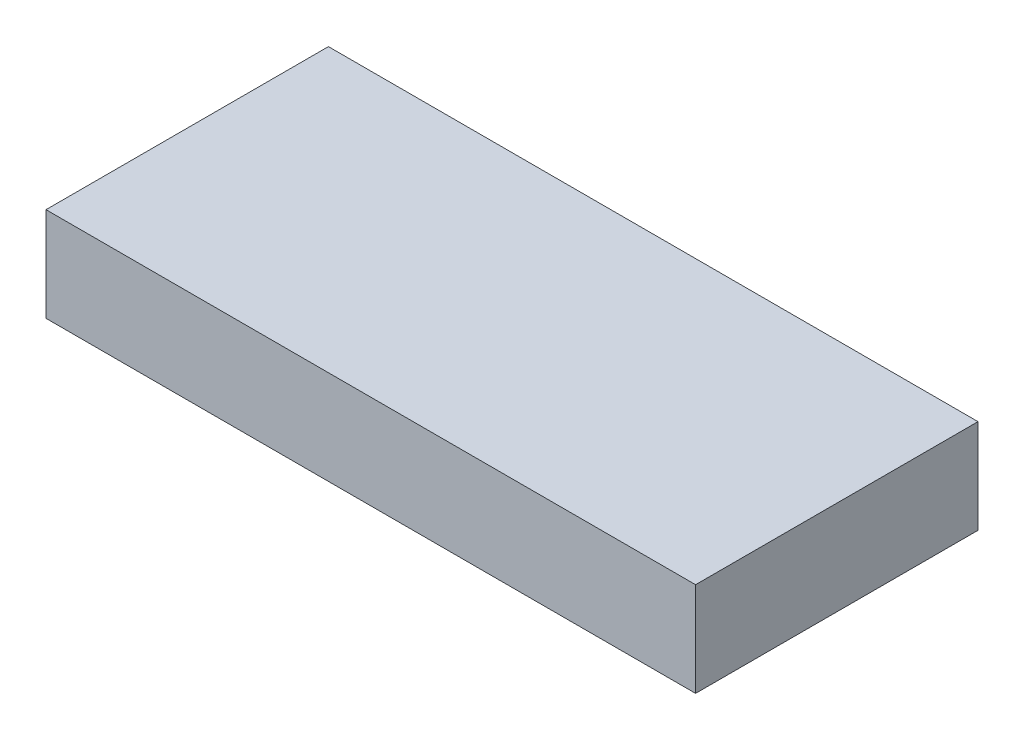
ISO-10303-21;
HEADER;
FILE_DESCRIPTION(('STEP AP214'),'2;1');
FILE_NAME('part.step','',(''),(''),'','','');
FILE_SCHEMA(('AUTOMOTIVE_DESIGN { 1 0 10303 214 1 1 1 1 }'));
ENDSEC;
DATA;
#1=APPLICATION_CONTEXT('core data for automotive mechanical design processes');
#2=APPLICATION_PROTOCOL_DEFINITION('international standard','automotive_design',2000,#1);
#3=PRODUCT_CONTEXT('',#1,'mechanical');
#4=PRODUCT('Part','Part','',(#3));
#5=PRODUCT_RELATED_PRODUCT_CATEGORY('part','',(#4));
#6=PRODUCT_DEFINITION_FORMATION('','',#4);
#7=PRODUCT_DEFINITION_CONTEXT('part definition',#1,'design');
#8=PRODUCT_DEFINITION('design','',#6,#7);
#9=PRODUCT_DEFINITION_SHAPE('','',#8);
#10=(LENGTH_UNIT() NAMED_UNIT(*) SI_UNIT(.MILLI.,.METRE.));
#11=(NAMED_UNIT(*) PLANE_ANGLE_UNIT() SI_UNIT($,.RADIAN.));
#12=(NAMED_UNIT(*) SI_UNIT($,.STERADIAN.) SOLID_ANGLE_UNIT());
#13=UNCERTAINTY_MEASURE_WITH_UNIT(LENGTH_MEASURE(1.E-05),#10,'distance_accuracy_value','');
#14=(GEOMETRIC_REPRESENTATION_CONTEXT(3) GLOBAL_UNCERTAINTY_ASSIGNED_CONTEXT((#13)) GLOBAL_UNIT_ASSIGNED_CONTEXT((#10,
#11,#12)) REPRESENTATION_CONTEXT('',''));
#15=CARTESIAN_POINT('',(0.,0.,0.));
#16=DIRECTION('',(0.,0.,1.));
#17=DIRECTION('',(1.,0.,0.));
#18=AXIS2_PLACEMENT_3D('',#15,#16,#17);
#19=CARTESIAN_POINT('',(69.,5.,15.));
#20=DIRECTION('',(0.,0.,-1.));
#21=DIRECTION('',(0.,1.,0.));
#22=AXIS2_PLACEMENT_3D('',#19,#20,#21);
#23=PLANE('',#22);
#24=DIRECTION('',(0.,-1.,0.));
#25=VECTOR('',#24,1.);
#26=CARTESIAN_POINT('',(0.,5.,15.));
#27=LINE('',#26,#25);
#28=CARTESIAN_POINT('',(0.,5.,15.));
#29=VERTEX_POINT('',#28);
#30=CARTESIAN_POINT('',(0.,-5.,15.));
#31=VERTEX_POINT('',#30);
#32=EDGE_CURVE('E77',#29,#31,#27,.T.);
#33=ORIENTED_EDGE('',*,*,#32,.T.);
#34=DIRECTION('',(-1.,0.,0.));
#35=VECTOR('',#34,1.);
#36=CARTESIAN_POINT('',(69.,-5.,15.));
#37=LINE('',#36,#35);
#38=CARTESIAN_POINT('',(69.,-5.,15.));
#39=VERTEX_POINT('',#38);
#40=EDGE_CURVE('E11',#39,#31,#37,.T.);
#41=ORIENTED_EDGE('',*,*,#40,.F.);
#42=DIRECTION('',(0.,-1.,0.));
#43=VECTOR('',#42,1.);
#44=CARTESIAN_POINT('',(69.,5.,15.));
#45=LINE('',#44,#43);
#46=CARTESIAN_POINT('',(69.,5.,15.));
#47=VERTEX_POINT('',#46);
#48=EDGE_CURVE('E95',#47,#39,#45,.T.);
#49=ORIENTED_EDGE('',*,*,#48,.F.);
#50=DIRECTION('',(-1.,0.,0.));
#51=VECTOR('',#50,1.);
#52=CARTESIAN_POINT('',(69.,5.,15.));
#53=LINE('',#52,#51);
#54=EDGE_CURVE('E89',#47,#29,#53,.T.);
#55=ORIENTED_EDGE('',*,*,#54,.T.);
#56=EDGE_LOOP('',(#33,#41,#49,#55));
#57=FACE_BOUND('',#56,.T.);
#58=ADVANCED_FACE('F33',(#57),#23,.F.);
#59=CARTESIAN_POINT('',(69.,-5.,15.));
#60=DIRECTION('',(0.,1.,0.));
#61=DIRECTION('',(0.,0.,1.));
#62=AXIS2_PLACEMENT_3D('',#59,#60,#61);
#63=PLANE('',#62);
#64=DIRECTION('',(0.,0.,-1.));
#65=VECTOR('',#64,1.);
#66=CARTESIAN_POINT('',(0.,-5.,15.));
#67=LINE('',#66,#65);
#68=CARTESIAN_POINT('',(0.,-5.,-15.));
#69=VERTEX_POINT('',#68);
#70=EDGE_CURVE('E73',#31,#69,#67,.T.);
#71=ORIENTED_EDGE('',*,*,#70,.T.);
#72=DIRECTION('',(-1.,0.,0.));
#73=VECTOR('',#72,1.);
#74=CARTESIAN_POINT('',(69.,-5.,-15.));
#75=LINE('',#74,#73);
#76=CARTESIAN_POINT('',(69.,-5.,-15.));
#77=VERTEX_POINT('',#76);
#78=EDGE_CURVE('E40',#77,#69,#75,.T.);
#79=ORIENTED_EDGE('',*,*,#78,.F.);
#80=DIRECTION('',(0.,0.,-1.));
#81=VECTOR('',#80,1.);
#82=CARTESIAN_POINT('',(69.,-5.,15.));
#83=LINE('',#82,#81);
#84=EDGE_CURVE('E85',#39,#77,#83,.T.);
#85=ORIENTED_EDGE('',*,*,#84,.F.);
#86=ORIENTED_EDGE('',*,*,#40,.T.);
#87=EDGE_LOOP('',(#71,#79,#85,#86));
#88=FACE_BOUND('',#87,.T.);
#89=ADVANCED_FACE('F84',(#88),#63,.F.);
#90=CARTESIAN_POINT('',(69.,5.,-15.));
#91=DIRECTION('',(0.,0.,1.));
#92=DIRECTION('',(0.,-1.,0.));
#93=AXIS2_PLACEMENT_3D('',#90,#91,#92);
#94=PLANE('',#93);
#95=DIRECTION('',(0.,1.,0.));
#96=VECTOR('',#95,1.);
#97=CARTESIAN_POINT('',(0.,5.,-15.));
#98=LINE('',#97,#96);
#99=CARTESIAN_POINT('',(0.,5.,-15.));
#100=VERTEX_POINT('',#99);
#101=EDGE_CURVE('E78',#69,#100,#98,.T.);
#102=ORIENTED_EDGE('',*,*,#101,.T.);
#103=DIRECTION('',(-1.,0.,0.));
#104=VECTOR('',#103,1.);
#105=CARTESIAN_POINT('',(69.,5.,-15.));
#106=LINE('',#105,#104);
#107=CARTESIAN_POINT('',(69.,5.,-15.));
#108=VERTEX_POINT('',#107);
#109=EDGE_CURVE('E101',#108,#100,#106,.T.);
#110=ORIENTED_EDGE('',*,*,#109,.F.);
#111=DIRECTION('',(0.,1.,0.));
#112=VECTOR('',#111,1.);
#113=CARTESIAN_POINT('',(69.,5.,-15.));
#114=LINE('',#113,#112);
#115=EDGE_CURVE('E52',#77,#108,#114,.T.);
#116=ORIENTED_EDGE('',*,*,#115,.F.);
#117=ORIENTED_EDGE('',*,*,#78,.T.);
#118=EDGE_LOOP('',(#102,#110,#116,#117));
#119=FACE_BOUND('',#118,.T.);
#120=ADVANCED_FACE('F104',(#119),#94,.F.);
#121=CARTESIAN_POINT('',(69.,5.,15.));
#122=DIRECTION('',(0.,-1.,0.));
#123=DIRECTION('',(0.,0.,-1.));
#124=AXIS2_PLACEMENT_3D('',#121,#122,#123);
#125=PLANE('',#124);
#126=DIRECTION('',(0.,0.,1.));
#127=VECTOR('',#126,1.);
#128=CARTESIAN_POINT('',(0.,5.,15.));
#129=LINE('',#128,#127);
#130=EDGE_CURVE('E93',#100,#29,#129,.T.);
#131=ORIENTED_EDGE('',*,*,#130,.T.);
#132=ORIENTED_EDGE('',*,*,#54,.F.);
#133=DIRECTION('',(0.,0.,1.));
#134=VECTOR('',#133,1.);
#135=CARTESIAN_POINT('',(69.,5.,15.));
#136=LINE('',#135,#134);
#137=EDGE_CURVE('E47',#108,#47,#136,.T.);
#138=ORIENTED_EDGE('',*,*,#137,.F.);
#139=ORIENTED_EDGE('',*,*,#109,.T.);
#140=EDGE_LOOP('',(#131,#132,#138,#139));
#141=FACE_BOUND('',#140,.T.);
#142=ADVANCED_FACE('F106',(#141),#125,.F.);
#143=CARTESIAN_POINT('',(69.,-5.,15.));
#144=DIRECTION('',(1.,0.,0.));
#145=DIRECTION('',(0.,0.,-1.));
#146=AXIS2_PLACEMENT_3D('',#143,#144,#145);
#147=PLANE('',#146);
#148=ORIENTED_EDGE('',*,*,#48,.T.);
#149=ORIENTED_EDGE('',*,*,#84,.T.);
#150=ORIENTED_EDGE('',*,*,#115,.T.);
#151=ORIENTED_EDGE('',*,*,#137,.T.);
#152=EDGE_LOOP('',(#148,#149,#150,#151));
#153=FACE_BOUND('',#152,.T.);
#154=ADVANCED_FACE('F107',(#153),#147,.T.);
#155=CARTESIAN_POINT('',(0.,-5.,15.));
#156=DIRECTION('',(1.,0.,0.));
#157=DIRECTION('',(0.,0.,-1.));
#158=AXIS2_PLACEMENT_3D('',#155,#156,#157);
#159=PLANE('',#158);
#160=ORIENTED_EDGE('',*,*,#32,.F.);
#161=ORIENTED_EDGE('',*,*,#130,.F.);
#162=ORIENTED_EDGE('',*,*,#101,.F.);
#163=ORIENTED_EDGE('',*,*,#70,.F.);
#164=EDGE_LOOP('',(#160,#161,#162,#163));
#165=FACE_BOUND('',#164,.T.);
#166=ADVANCED_FACE('F74',(#165),#159,.F.);
#167=CLOSED_SHELL('',(#58,#89,#120,#142,#154,#166));
#168=MANIFOLD_SOLID_BREP('B2',#167);
#169=ADVANCED_BREP_SHAPE_REPRESENTATION('',(#18,#168),#14);
#170=SHAPE_DEFINITION_REPRESENTATION(#9,#169);
ENDSEC;
END-ISO-10303-21;
